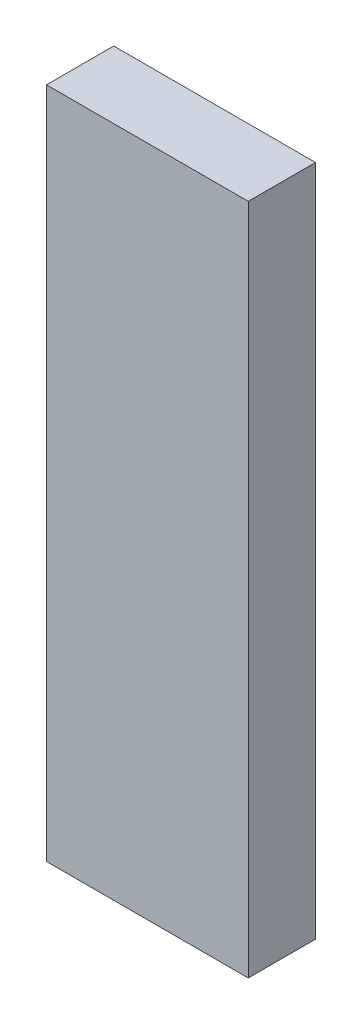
ISO-10303-21;
HEADER;
FILE_DESCRIPTION(('STEP AP214'),'2;1');
FILE_NAME('part.step','',(''),(''),'','','');
FILE_SCHEMA(('AUTOMOTIVE_DESIGN { 1 0 10303 214 1 1 1 1 }'));
ENDSEC;
DATA;
#1=APPLICATION_CONTEXT('core data for automotive mechanical design processes');
#2=APPLICATION_PROTOCOL_DEFINITION('international standard','automotive_design',2000,#1);
#3=PRODUCT_CONTEXT('',#1,'mechanical');
#4=PRODUCT('Part','Part','',(#3));
#5=PRODUCT_RELATED_PRODUCT_CATEGORY('part','',(#4));
#6=PRODUCT_DEFINITION_FORMATION('','',#4);
#7=PRODUCT_DEFINITION_CONTEXT('part definition',#1,'design');
#8=PRODUCT_DEFINITION('design','',#6,#7);
#9=PRODUCT_DEFINITION_SHAPE('','',#8);
#10=(LENGTH_UNIT() NAMED_UNIT(*) SI_UNIT(.MILLI.,.METRE.));
#11=(NAMED_UNIT(*) PLANE_ANGLE_UNIT() SI_UNIT($,.RADIAN.));
#12=(NAMED_UNIT(*) SI_UNIT($,.STERADIAN.) SOLID_ANGLE_UNIT());
#13=UNCERTAINTY_MEASURE_WITH_UNIT(LENGTH_MEASURE(1.E-05),#10,'distance_accuracy_value','');
#14=(GEOMETRIC_REPRESENTATION_CONTEXT(3) GLOBAL_UNCERTAINTY_ASSIGNED_CONTEXT((#13)) GLOBAL_UNIT_ASSIGNED_CONTEXT((#10,
#11,#12)) REPRESENTATION_CONTEXT('',''));
#15=CARTESIAN_POINT('',(0.,0.,0.));
#16=DIRECTION('',(0.,0.,1.));
#17=DIRECTION('',(1.,0.,0.));
#18=AXIS2_PLACEMENT_3D('',#15,#16,#17);
#19=CARTESIAN_POINT('',(30.,100.,20.));
#20=DIRECTION('',(-1.,0.,0.));
#21=DIRECTION('',(0.,-1.,0.));
#22=AXIS2_PLACEMENT_3D('',#19,#20,#21);
#23=PLANE('',#22);
#24=DIRECTION('',(0.,1.,0.));
#25=VECTOR('',#24,1.);
#26=CARTESIAN_POINT('',(30.,100.,0.));
#27=LINE('',#26,#25);
#28=CARTESIAN_POINT('',(30.,-100.,0.));
#29=VERTEX_POINT('',#28);
#30=CARTESIAN_POINT('',(30.,100.,0.));
#31=VERTEX_POINT('',#30);
#32=EDGE_CURVE('E143',#29,#31,#27,.T.);
#33=ORIENTED_EDGE('',*,*,#32,.T.);
#34=DIRECTION('',(0.,0.,-1.));
#35=VECTOR('',#34,1.);
#36=CARTESIAN_POINT('',(30.,100.,20.));
#37=LINE('',#36,#35);
#38=CARTESIAN_POINT('',(30.,100.,20.));
#39=VERTEX_POINT('',#38);
#40=EDGE_CURVE('E44',#39,#31,#37,.T.);
#41=ORIENTED_EDGE('',*,*,#40,.F.);
#42=DIRECTION('',(0.,1.,0.));
#43=VECTOR('',#42,1.);
#44=CARTESIAN_POINT('',(30.,100.,20.));
#45=LINE('',#44,#43);
#46=CARTESIAN_POINT('',(30.,-100.,20.));
#47=VERTEX_POINT('',#46);
#48=EDGE_CURVE('E148',#47,#39,#45,.T.);
#49=ORIENTED_EDGE('',*,*,#48,.F.);
#50=DIRECTION('',(0.,0.,-1.));
#51=VECTOR('',#50,1.);
#52=CARTESIAN_POINT('',(30.,-100.,20.));
#53=LINE('',#52,#51);
#54=EDGE_CURVE('E11',#47,#29,#53,.T.);
#55=ORIENTED_EDGE('',*,*,#54,.T.);
#56=EDGE_LOOP('',(#33,#41,#49,#55));
#57=FACE_BOUND('',#56,.T.);
#58=ADVANCED_FACE('F37',(#57),#23,.F.);
#59=CARTESIAN_POINT('',(-30.,100.,20.));
#60=DIRECTION('',(0.,-1.,0.));
#61=DIRECTION('',(0.,0.,-1.));
#62=AXIS2_PLACEMENT_3D('',#59,#60,#61);
#63=PLANE('',#62);
#64=DIRECTION('',(-1.,0.,0.));
#65=VECTOR('',#64,1.);
#66=CARTESIAN_POINT('',(-30.,100.,0.));
#67=LINE('',#66,#65);
#68=CARTESIAN_POINT('',(-30.,100.,0.));
#69=VERTEX_POINT('',#68);
#70=EDGE_CURVE('E157',#31,#69,#67,.T.);
#71=ORIENTED_EDGE('',*,*,#70,.T.);
#72=DIRECTION('',(0.,0.,-1.));
#73=VECTOR('',#72,1.);
#74=CARTESIAN_POINT('',(-30.,100.,20.));
#75=LINE('',#74,#73);
#76=CARTESIAN_POINT('',(-30.,100.,20.));
#77=VERTEX_POINT('',#76);
#78=EDGE_CURVE('E162',#77,#69,#75,.T.);
#79=ORIENTED_EDGE('',*,*,#78,.F.);
#80=DIRECTION('',(-1.,0.,0.));
#81=VECTOR('',#80,1.);
#82=CARTESIAN_POINT('',(-30.,100.,20.));
#83=LINE('',#82,#81);
#84=EDGE_CURVE('E151',#39,#77,#83,.T.);
#85=ORIENTED_EDGE('',*,*,#84,.F.);
#86=ORIENTED_EDGE('',*,*,#40,.T.);
#87=EDGE_LOOP('',(#71,#79,#85,#86));
#88=FACE_BOUND('',#87,.T.);
#89=ADVANCED_FACE('F168',(#88),#63,.F.);
#90=CARTESIAN_POINT('',(-30.,-100.,20.));
#91=DIRECTION('',(1.,0.,0.));
#92=DIRECTION('',(0.,0.,-1.));
#93=AXIS2_PLACEMENT_3D('',#90,#91,#92);
#94=PLANE('',#93);
#95=DIRECTION('',(0.,-1.,0.));
#96=VECTOR('',#95,1.);
#97=CARTESIAN_POINT('',(-30.,-100.,0.));
#98=LINE('',#97,#96);
#99=CARTESIAN_POINT('',(-30.,-100.,0.));
#100=VERTEX_POINT('',#99);
#101=EDGE_CURVE('E83',#69,#100,#98,.T.);
#102=ORIENTED_EDGE('',*,*,#101,.T.);
#103=DIRECTION('',(0.,0.,-1.));
#104=VECTOR('',#103,1.);
#105=CARTESIAN_POINT('',(-30.,-100.,20.));
#106=LINE('',#105,#104);
#107=CARTESIAN_POINT('',(-30.,-100.,20.));
#108=VERTEX_POINT('',#107);
#109=EDGE_CURVE('E155',#108,#100,#106,.T.);
#110=ORIENTED_EDGE('',*,*,#109,.F.);
#111=DIRECTION('',(0.,-1.,0.));
#112=VECTOR('',#111,1.);
#113=CARTESIAN_POINT('',(-30.,-100.,20.));
#114=LINE('',#113,#112);
#115=EDGE_CURVE('E153',#77,#108,#114,.T.);
#116=ORIENTED_EDGE('',*,*,#115,.F.);
#117=ORIENTED_EDGE('',*,*,#78,.T.);
#118=EDGE_LOOP('',(#102,#110,#116,#117));
#119=FACE_BOUND('',#118,.T.);
#120=ADVANCED_FACE('F179',(#119),#94,.F.);
#121=CARTESIAN_POINT('',(-15.,-100.,20.));
#122=DIRECTION('',(0.,1.,0.));
#123=DIRECTION('',(0.,0.,1.));
#124=AXIS2_PLACEMENT_3D('',#121,#122,#123);
#125=PLANE('',#124);
#126=DIRECTION('',(0.,0.,-1.));
#127=VECTOR('',#126,1.);
#128=CARTESIAN_POINT('',(-6.05,-100.,13.55));
#129=LINE('',#128,#127);
#130=CARTESIAN_POINT('',(-6.05,-100.,13.55));
#131=VERTEX_POINT('',#130);
#132=CARTESIAN_POINT('',(-6.05,-100.,6.45));
#133=VERTEX_POINT('',#132);
#134=EDGE_CURVE('E137',#131,#133,#129,.T.);
#135=ORIENTED_EDGE('',*,*,#134,.F.);
#136=DIRECTION('',(-1.,0.,0.));
#137=VECTOR('',#136,1.);
#138=CARTESIAN_POINT('',(6.05,-100.,13.55));
#139=LINE('',#138,#137);
#140=CARTESIAN_POINT('',(6.05,-100.,13.55));
#141=VERTEX_POINT('',#140);
#142=EDGE_CURVE('E51',#141,#131,#139,.T.);
#143=ORIENTED_EDGE('',*,*,#142,.F.);
#144=DIRECTION('',(0.,0.,1.));
#145=VECTOR('',#144,1.);
#146=CARTESIAN_POINT('',(6.05,-100.,6.45));
#147=LINE('',#146,#145);
#148=CARTESIAN_POINT('',(6.05,-100.,6.45));
#149=VERTEX_POINT('',#148);
#150=EDGE_CURVE('E128',#149,#141,#147,.T.);
#151=ORIENTED_EDGE('',*,*,#150,.F.);
#152=DIRECTION('',(1.,0.,0.));
#153=VECTOR('',#152,1.);
#154=CARTESIAN_POINT('',(-6.05,-100.,6.45));
#155=LINE('',#154,#153);
#156=EDGE_CURVE('E131',#133,#149,#155,.T.);
#157=ORIENTED_EDGE('',*,*,#156,.F.);
#158=EDGE_LOOP('',(#135,#143,#151,#157));
#159=FACE_BOUND('',#158,.T.);
#160=DIRECTION('',(1.,0.,0.));
#161=VECTOR('',#160,1.);
#162=CARTESIAN_POINT('',(-15.,-100.,0.));
#163=LINE('',#162,#161);
#164=EDGE_CURVE('E149',#100,#29,#163,.T.);
#165=ORIENTED_EDGE('',*,*,#164,.T.);
#166=ORIENTED_EDGE('',*,*,#54,.F.);
#167=DIRECTION('',(1.,0.,0.));
#168=VECTOR('',#167,1.);
#169=CARTESIAN_POINT('',(-15.,-100.,20.));
#170=LINE('',#169,#168);
#171=EDGE_CURVE('E60',#108,#47,#170,.T.);
#172=ORIENTED_EDGE('',*,*,#171,.F.);
#173=ORIENTED_EDGE('',*,*,#109,.T.);
#174=EDGE_LOOP('',(#165,#166,#172,#173));
#175=FACE_BOUND('',#174,.T.);
#176=ADVANCED_FACE('F176',(#159,#175),#125,.F.);
#177=CARTESIAN_POINT('',(0.,0.,20.));
#178=DIRECTION('',(0.,0.,-1.));
#179=DIRECTION('',(-1.,0.,0.));
#180=AXIS2_PLACEMENT_3D('',#177,#178,#179);
#181=PLANE('',#180);
#182=ORIENTED_EDGE('',*,*,#171,.T.);
#183=ORIENTED_EDGE('',*,*,#48,.T.);
#184=ORIENTED_EDGE('',*,*,#84,.T.);
#185=ORIENTED_EDGE('',*,*,#115,.T.);
#186=EDGE_LOOP('',(#182,#183,#184,#185));
#187=FACE_BOUND('',#186,.T.);
#188=ADVANCED_FACE('F177',(#187),#181,.F.);
#189=CARTESIAN_POINT('',(0.,0.,0.));
#190=DIRECTION('',(0.,0.,-1.));
#191=DIRECTION('',(-1.,0.,0.));
#192=AXIS2_PLACEMENT_3D('',#189,#190,#191);
#193=PLANE('',#192);
#194=ORIENTED_EDGE('',*,*,#32,.F.);
#195=ORIENTED_EDGE('',*,*,#164,.F.);
#196=ORIENTED_EDGE('',*,*,#101,.F.);
#197=ORIENTED_EDGE('',*,*,#70,.F.);
#198=EDGE_LOOP('',(#194,#195,#196,#197));
#199=FACE_BOUND('',#198,.T.);
#200=ADVANCED_FACE('F174',(#199),#193,.T.);
#201=CARTESIAN_POINT('',(6.05,-67.,13.55));
#202=DIRECTION('',(0.,0.,1.));
#203=DIRECTION('',(1.,0.,0.));
#204=AXIS2_PLACEMENT_3D('',#201,#202,#203);
#205=PLANE('',#204);
#206=ORIENTED_EDGE('',*,*,#142,.T.);
#207=DIRECTION('',(0.,-1.,0.));
#208=VECTOR('',#207,1.);
#209=CARTESIAN_POINT('',(-6.05,-67.,13.55));
#210=LINE('',#209,#208);
#211=CARTESIAN_POINT('',(-6.05,-67.,13.55));
#212=VERTEX_POINT('',#211);
#213=EDGE_CURVE('E106',#212,#131,#210,.T.);
#214=ORIENTED_EDGE('',*,*,#213,.F.);
#215=DIRECTION('',(-1.,0.,0.));
#216=VECTOR('',#215,1.);
#217=CARTESIAN_POINT('',(6.05,-67.,13.55));
#218=LINE('',#217,#216);
#219=CARTESIAN_POINT('',(6.05,-67.,13.55));
#220=VERTEX_POINT('',#219);
#221=EDGE_CURVE('E110',#220,#212,#218,.T.);
#222=ORIENTED_EDGE('',*,*,#221,.F.);
#223=DIRECTION('',(0.,-1.,0.));
#224=VECTOR('',#223,1.);
#225=CARTESIAN_POINT('',(6.05,-67.,13.55));
#226=LINE('',#225,#224);
#227=EDGE_CURVE('E141',#220,#141,#226,.T.);
#228=ORIENTED_EDGE('',*,*,#227,.T.);
#229=EDGE_LOOP('',(#206,#214,#222,#228));
#230=FACE_BOUND('',#229,.T.);
#231=ADVANCED_FACE('F108',(#230),#205,.F.);
#232=CARTESIAN_POINT('',(6.05,-67.,6.45));
#233=DIRECTION('',(1.,0.,0.));
#234=DIRECTION('',(0.,0.,-1.));
#235=AXIS2_PLACEMENT_3D('',#232,#233,#234);
#236=PLANE('',#235);
#237=ORIENTED_EDGE('',*,*,#150,.T.);
#238=ORIENTED_EDGE('',*,*,#227,.F.);
#239=DIRECTION('',(0.,0.,1.));
#240=VECTOR('',#239,1.);
#241=CARTESIAN_POINT('',(6.05,-67.,6.45));
#242=LINE('',#241,#240);
#243=CARTESIAN_POINT('',(6.05,-67.,6.45));
#244=VERTEX_POINT('',#243);
#245=EDGE_CURVE('E116',#244,#220,#242,.T.);
#246=ORIENTED_EDGE('',*,*,#245,.F.);
#247=DIRECTION('',(0.,-1.,0.));
#248=VECTOR('',#247,1.);
#249=CARTESIAN_POINT('',(6.05,-67.,6.45));
#250=LINE('',#249,#248);
#251=EDGE_CURVE('E144',#244,#149,#250,.T.);
#252=ORIENTED_EDGE('',*,*,#251,.T.);
#253=EDGE_LOOP('',(#237,#238,#246,#252));
#254=FACE_BOUND('',#253,.T.);
#255=ADVANCED_FACE('F233',(#254),#236,.F.);
#256=CARTESIAN_POINT('',(-6.05,-67.,6.45));
#257=DIRECTION('',(0.,0.,-1.));
#258=DIRECTION('',(-1.,0.,0.));
#259=AXIS2_PLACEMENT_3D('',#256,#257,#258);
#260=PLANE('',#259);
#261=ORIENTED_EDGE('',*,*,#156,.T.);
#262=ORIENTED_EDGE('',*,*,#251,.F.);
#263=DIRECTION('',(1.,0.,0.));
#264=VECTOR('',#263,1.);
#265=CARTESIAN_POINT('',(-6.05,-67.,6.45));
#266=LINE('',#265,#264);
#267=CARTESIAN_POINT('',(-6.05,-67.,6.45));
#268=VERTEX_POINT('',#267);
#269=EDGE_CURVE('E124',#268,#244,#266,.T.);
#270=ORIENTED_EDGE('',*,*,#269,.F.);
#271=DIRECTION('',(0.,-1.,0.));
#272=VECTOR('',#271,1.);
#273=CARTESIAN_POINT('',(-6.05,-67.,6.45));
#274=LINE('',#273,#272);
#275=EDGE_CURVE('E115',#268,#133,#274,.T.);
#276=ORIENTED_EDGE('',*,*,#275,.T.);
#277=EDGE_LOOP('',(#261,#262,#270,#276));
#278=FACE_BOUND('',#277,.T.);
#279=ADVANCED_FACE('F243',(#278),#260,.F.);
#280=CARTESIAN_POINT('',(-6.05,-67.,13.55));
#281=DIRECTION('',(-1.,0.,0.));
#282=DIRECTION('',(0.,0.,1.));
#283=AXIS2_PLACEMENT_3D('',#280,#281,#282);
#284=PLANE('',#283);
#285=ORIENTED_EDGE('',*,*,#134,.T.);
#286=ORIENTED_EDGE('',*,*,#275,.F.);
#287=DIRECTION('',(0.,0.,-1.));
#288=VECTOR('',#287,1.);
#289=CARTESIAN_POINT('',(-6.05,-67.,13.55));
#290=LINE('',#289,#288);
#291=EDGE_CURVE('E119',#212,#268,#290,.T.);
#292=ORIENTED_EDGE('',*,*,#291,.F.);
#293=ORIENTED_EDGE('',*,*,#213,.T.);
#294=EDGE_LOOP('',(#285,#286,#292,#293));
#295=FACE_BOUND('',#294,.T.);
#296=ADVANCED_FACE('F120',(#295),#284,.F.);
#297=CARTESIAN_POINT('',(0.,-67.,0.));
#298=DIRECTION('',(0.,-1.,0.));
#299=DIRECTION('',(0.,0.,-1.));
#300=AXIS2_PLACEMENT_3D('',#297,#298,#299);
#301=PLANE('',#300);
#302=ORIENTED_EDGE('',*,*,#221,.T.);
#303=ORIENTED_EDGE('',*,*,#291,.T.);
#304=ORIENTED_EDGE('',*,*,#269,.T.);
#305=ORIENTED_EDGE('',*,*,#245,.T.);
#306=EDGE_LOOP('',(#302,#303,#304,#305));
#307=FACE_BOUND('',#306,.T.);
#308=ADVANCED_FACE('F126',(#307),#301,.T.);
#309=CLOSED_SHELL('',(#58,#89,#120,#176,#188,#200,#231,#255,#279,#296,#308));
#310=MANIFOLD_SOLID_BREP('B2',#309);
#311=ADVANCED_BREP_SHAPE_REPRESENTATION('',(#18,#310),#14);
#312=SHAPE_DEFINITION_REPRESENTATION(#9,#311);
ENDSEC;
END-ISO-10303-21;
